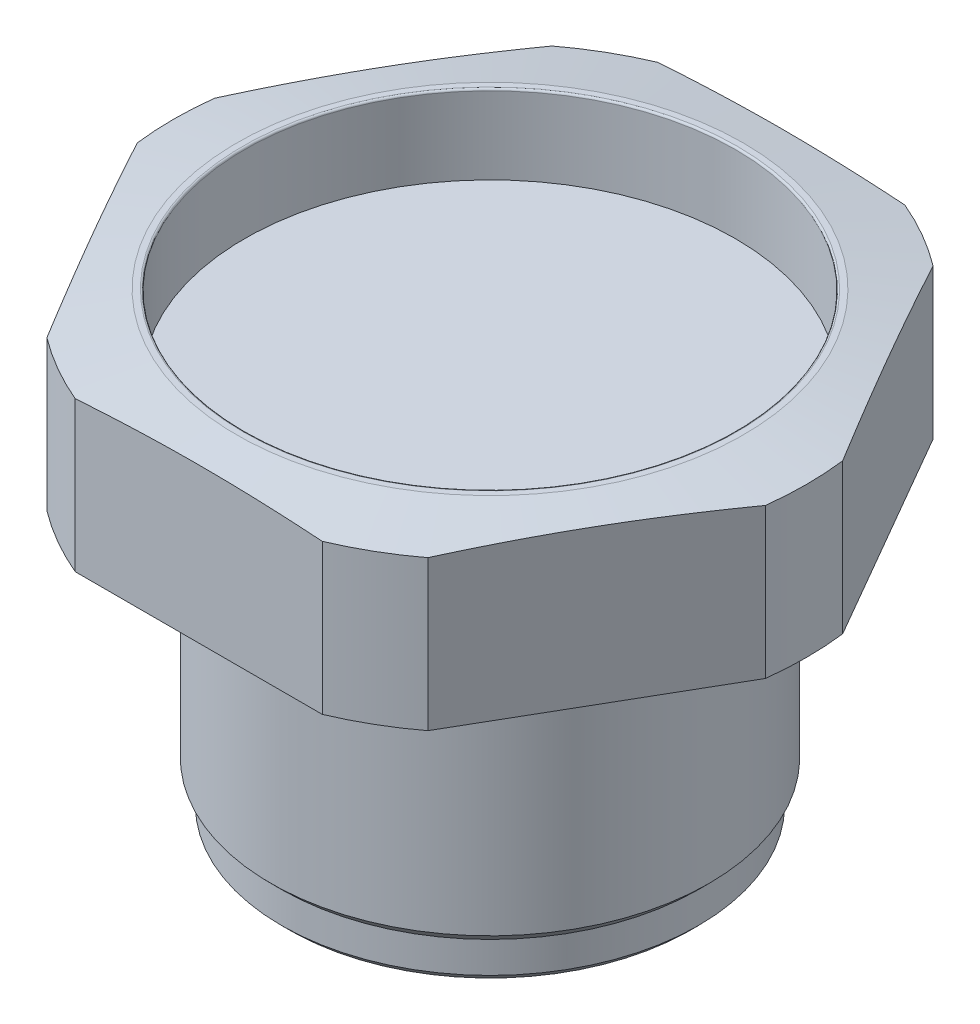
ISO-10303-21;
HEADER;
FILE_DESCRIPTION(('STEP AP214'),'2;1');
FILE_NAME('part.step','',(''),(''),'','','');
FILE_SCHEMA(('AUTOMOTIVE_DESIGN { 1 0 10303 214 1 1 1 1 }'));
ENDSEC;
DATA;
#1=APPLICATION_CONTEXT('core data for automotive mechanical design processes');
#2=APPLICATION_PROTOCOL_DEFINITION('international standard','automotive_design',2000,#1);
#3=PRODUCT_CONTEXT('',#1,'mechanical');
#4=PRODUCT('Part','Part','',(#3));
#5=PRODUCT_RELATED_PRODUCT_CATEGORY('part','',(#4));
#6=PRODUCT_DEFINITION_FORMATION('','',#4);
#7=PRODUCT_DEFINITION_CONTEXT('part definition',#1,'design');
#8=PRODUCT_DEFINITION('design','',#6,#7);
#9=PRODUCT_DEFINITION_SHAPE('','',#8);
#10=(LENGTH_UNIT() NAMED_UNIT(*) SI_UNIT(.MILLI.,.METRE.));
#11=(NAMED_UNIT(*) PLANE_ANGLE_UNIT() SI_UNIT($,.RADIAN.));
#12=(NAMED_UNIT(*) SI_UNIT($,.STERADIAN.) SOLID_ANGLE_UNIT());
#13=UNCERTAINTY_MEASURE_WITH_UNIT(LENGTH_MEASURE(1.E-05),#10,'distance_accuracy_value','');
#14=(GEOMETRIC_REPRESENTATION_CONTEXT(3) GLOBAL_UNCERTAINTY_ASSIGNED_CONTEXT((#13)) GLOBAL_UNIT_ASSIGNED_CONTEXT((#10,
#11,#12)) REPRESENTATION_CONTEXT('',''));
#15=CARTESIAN_POINT('',(0.,0.,0.));
#16=DIRECTION('',(0.,0.,1.));
#17=DIRECTION('',(1.,0.,0.));
#18=AXIS2_PLACEMENT_3D('',#15,#16,#17);
#19=CARTESIAN_POINT('',(27.178,-38.354,0.));
#20=DIRECTION('',(0.,-1.,0.));
#21=DIRECTION('',(0.,0.,-1.));
#22=AXIS2_PLACEMENT_3D('',#19,#20,#21);
#23=PLANE('',#22);
#24=CARTESIAN_POINT('',(0.,-38.354,0.));
#25=DIRECTION('',(0.,-1.,0.));
#26=DIRECTION('',(0.,0.,-1.));
#27=AXIS2_PLACEMENT_3D('',#24,#25,#26);
#28=CIRCLE('',#27,23.7209044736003);
#29=CARTESIAN_POINT('',(0.,-38.354,-23.7209044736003));
#30=VERTEX_POINT('',#29);
#31=EDGE_CURVE('E195',#30,#30,#28,.T.);
#32=ORIENTED_EDGE('',*,*,#31,.F.);
#33=EDGE_LOOP('',(#32));
#34=FACE_BOUND('',#33,.T.);
#35=CARTESIAN_POINT('',(0.,-38.354,0.));
#36=DIRECTION('',(0.,-1.,0.));
#37=DIRECTION('',(0.,0.,-1.));
#38=AXIS2_PLACEMENT_3D('',#35,#36,#37);
#39=CIRCLE('',#38,26.162);
#40=CARTESIAN_POINT('',(0.,-38.354,-26.162));
#41=VERTEX_POINT('',#40);
#42=EDGE_CURVE('E177',#41,#41,#39,.T.);
#43=ORIENTED_EDGE('',*,*,#42,.T.);
#44=EDGE_LOOP('',(#43));
#45=FACE_BOUND('',#44,.T.);
#46=ADVANCED_FACE('F33',(#34,#45),#23,.T.);
#47=CARTESIAN_POINT('',(0.,-8.96894233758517,0.));
#48=DIRECTION('',(0.,-1.,0.));
#49=DIRECTION('',(0.,0.,-1.));
#50=AXIS2_PLACEMENT_3D('',#47,#48,#49);
#51=CYLINDRICAL_SURFACE('',#50,27.178);
#52=CARTESIAN_POINT('',(0.,-0.508000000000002,0.));
#53=DIRECTION('',(0.,-1.,0.));
#54=DIRECTION('',(0.,0.,-1.));
#55=AXIS2_PLACEMENT_3D('',#52,#53,#54);
#56=CIRCLE('',#55,27.178);
#57=CARTESIAN_POINT('',(0.,-0.508000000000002,-27.178));
#58=VERTEX_POINT('',#57);
#59=EDGE_CURVE('E189',#58,#58,#56,.T.);
#60=ORIENTED_EDGE('',*,*,#59,.T.);
#61=EDGE_LOOP('',(#60));
#62=FACE_BOUND('',#61,.T.);
#63=CARTESIAN_POINT('',(0.,-5.08,0.));
#64=DIRECTION('',(0.,-1.,0.));
#65=DIRECTION('',(1.,0.,0.));
#66=AXIS2_PLACEMENT_3D('',#63,#64,#65);
#67=CIRCLE('',#66,27.178);
#68=CARTESIAN_POINT('',(27.178,-5.08,0.));
#69=VERTEX_POINT('',#68);
#70=EDGE_CURVE('E186',#69,#69,#67,.T.);
#71=ORIENTED_EDGE('',*,*,#70,.F.);
#72=EDGE_LOOP('',(#71));
#73=FACE_BOUND('',#72,.T.);
#74=ADVANCED_FACE('F216',(#62,#73),#51,.T.);
#75=CARTESIAN_POINT('',(0.,19.5502207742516,0.));
#76=DIRECTION('',(0.,-1.,0.));
#77=DIRECTION('',(0.,0.,-1.));
#78=AXIS2_PLACEMENT_3D('',#75,#76,#77);
#79=CONICAL_SURFACE('',#78,41.275,1.39626340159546);
#80=CARTESIAN_POINT('',(0.,21.0058,0.));
#81=DIRECTION('',(0.,-1.,0.));
#82=DIRECTION('',(0.,0.,-1.));
#83=AXIS2_PLACEMENT_3D('',#80,#81,#82);
#84=CIRCLE('',#83,33.02);
#85=CARTESIAN_POINT('',(0.,21.0058,-33.02));
#86=VERTEX_POINT('',#85);
#87=EDGE_CURVE('E386',#86,#86,#84,.T.);
#88=ORIENTED_EDGE('',*,*,#87,.T.);
#89=EDGE_LOOP('',(#88));
#90=FACE_BOUND('',#89,.T.);
#91=CARTESIAN_POINT('',(0.,19.5502207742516,0.));
#92=DIRECTION('',(0.,-1.,0.));
#93=DIRECTION('',(0.,0.,-1.));
#94=AXIS2_PLACEMENT_3D('',#91,#92,#93);
#95=CIRCLE('',#94,41.275);
#96=CARTESIAN_POINT('',(-40.9659173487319,19.5502207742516,5.04174977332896));
#97=VERTEX_POINT('',#96);
#98=CARTESIAN_POINT('',(-40.9659173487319,19.5502207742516,-5.04174977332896));
#99=VERTEX_POINT('',#98);
#100=EDGE_CURVE('E137',#97,#99,#95,.T.);
#101=ORIENTED_EDGE('',*,*,#100,.F.);
#102=CARTESIAN_POINT('',(-40.9673696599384,19.5500207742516,5.0392342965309));
#103=CARTESIAN_POINT('',(-40.6318536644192,19.5962299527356,5.62036504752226));
#104=CARTESIAN_POINT('',(-40.2962544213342,19.640002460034,6.20163998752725));
#105=CARTESIAN_POINT('',(-39.6248953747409,19.7223985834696,7.36446796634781));
#106=CARTESIAN_POINT('',(-39.2891355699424,19.7610221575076,7.94602100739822));
#107=CARTESIAN_POINT('',(-38.2816022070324,19.8687583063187,9.691119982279));
#108=CARTESIAN_POINT('',(-37.609604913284,19.9297320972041,10.8550534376));
#109=CARTESIAN_POINT('',(-36.2660437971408,20.0280404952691,13.182169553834));
#110=CARTESIAN_POINT('',(-35.5944805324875,20.0654054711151,14.3453512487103));
#111=CARTESIAN_POINT('',(-34.251138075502,20.1153717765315,16.6720886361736));
#112=CARTESIAN_POINT('',(-33.5793588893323,20.127973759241,17.8356443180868));
#113=CARTESIAN_POINT('',(-32.2358005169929,20.127973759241,20.1627556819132));
#114=CARTESIAN_POINT('',(-31.5640213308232,20.1153717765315,21.3263113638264));
#115=CARTESIAN_POINT('',(-30.2206788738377,20.0654054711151,23.6530487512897));
#116=CARTESIAN_POINT('',(-29.5491156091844,20.0280404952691,24.816230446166));
#117=CARTESIAN_POINT('',(-28.2055544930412,19.9297320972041,27.1433465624));
#118=CARTESIAN_POINT('',(-27.5335571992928,19.8687583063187,28.307280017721));
#119=CARTESIAN_POINT('',(-26.5260238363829,19.7610221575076,30.0523789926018));
#120=CARTESIAN_POINT('',(-26.1902640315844,19.7223985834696,30.6339320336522));
#121=CARTESIAN_POINT('',(-25.5189049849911,19.640002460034,31.7967600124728));
#122=CARTESIAN_POINT('',(-25.183305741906,19.5962299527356,32.3780349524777));
#123=CARTESIAN_POINT('',(-24.8477897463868,19.5500207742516,32.9591657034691));
#124=B_SPLINE_CURVE_WITH_KNOTS('',3,(#102,#103,#104,#105,#106,#107,#108,#109,#110,#111,#112,
#113,#114,#115,#116,#117,#118,#119,#120,#121,#122,#123),.UNSPECIFIED.,.F.,.F.,(4,2,2,2,2,2,2,2,
2,2,4),(0.,2.01785524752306,4.03572699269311,8.07165217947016,12.1023752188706,16.132991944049,
20.1636086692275,24.1943317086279,28.230256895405,30.248128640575,32.2659838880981),.UNSPECIFIED.);
#125=CARTESIAN_POINT('',(-24.8492420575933,19.5502207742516,32.956650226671));
#126=VERTEX_POINT('',#125);
#127=EDGE_CURVE('E385',#97,#126,#124,.T.);
#128=ORIENTED_EDGE('',*,*,#127,.T.);
#129=CARTESIAN_POINT('',(-16.1166752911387,19.5502207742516,37.9984));
#130=VERTEX_POINT('',#129);
#131=EDGE_CURVE('E377',#130,#126,#95,.T.);
#132=ORIENTED_EDGE('',*,*,#131,.F.);
#133=CARTESIAN_POINT('',(-57.8639051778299,14.6218698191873,37.9984));
#134=CARTESIAN_POINT('',(-57.0019930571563,14.7489031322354,37.9984));
#135=CARTESIAN_POINT('',(-56.139958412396,14.8751046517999,37.9984));
#136=CARTESIAN_POINT('',(-54.4156199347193,15.125664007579,37.9984));
#137=CARTESIAN_POINT('',(-53.5533161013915,15.2500218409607,37.9984));
#138=CARTESIAN_POINT('',(-50.9659374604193,15.6200635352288,37.9984));
#139=CARTESIAN_POINT('',(-49.2404266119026,15.8627109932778,37.9984));
#140=CARTESIAN_POINT('',(-45.7873021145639,16.3382293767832,37.9984));
#141=CARTESIAN_POINT('',(-44.0596878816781,16.5710960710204,37.9984));
#142=CARTESIAN_POINT('',(-40.6028670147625,17.0246892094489,37.9984));
#143=CARTESIAN_POINT('',(-38.8736603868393,17.245415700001,37.9984));
#144=CARTESIAN_POINT('',(-35.419217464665,17.6711956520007,37.9984));
#145=CARTESIAN_POINT('',(-33.6939873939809,17.8762993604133,37.9984));
#146=CARTESIAN_POINT('',(-30.2414345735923,18.2682133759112,37.9984));
#147=CARTESIAN_POINT('',(-28.5141118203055,18.4550236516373,37.9984));
#148=CARTESIAN_POINT('',(-25.0572784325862,18.8062070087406,37.9984));
#149=CARTESIAN_POINT('',(-23.3277679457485,18.9705815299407,37.9984));
#150=CARTESIAN_POINT('',(-19.8663595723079,19.2721663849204,37.9984));
#151=CARTESIAN_POINT('',(-18.1344616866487,19.4093767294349,37.9984));
#152=CARTESIAN_POINT('',(-14.6602163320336,19.6521327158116,37.9984));
#153=CARTESIAN_POINT('',(-12.9178580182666,19.7575264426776,37.9984));
#154=CARTESIAN_POINT('',(-10.3029433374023,19.8876204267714,37.9984));
#155=CARTESIAN_POINT('',(-9.43107075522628,19.9263191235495,37.9984));
#156=CARTESIAN_POINT('',(-7.68694739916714,19.9938955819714,37.9984));
#157=CARTESIAN_POINT('',(-6.81469662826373,20.0227734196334,37.9984));
#158=CARTESIAN_POINT('',(-5.0700654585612,20.0703033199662,37.9984));
#159=CARTESIAN_POINT('',(-4.19768510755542,20.0889571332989,37.9984));
#160=CARTESIAN_POINT('',(-2.45276864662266,20.1157789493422,37.9984));
#161=CARTESIAN_POINT('',(-1.58023253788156,20.1239470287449,37.9984));
#162=CARTESIAN_POINT('',(0.164877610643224,20.1296767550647,37.9984));
#163=CARTESIAN_POINT('',(1.03745165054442,20.1272383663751,37.9984));
#164=CARTESIAN_POINT('',(2.78250560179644,20.1117916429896,37.9984));
#165=CARTESIAN_POINT('',(3.65498551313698,20.0987833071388,37.9984));
#166=CARTESIAN_POINT('',(5.40109406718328,20.0623572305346,37.9984));
#167=CARTESIAN_POINT('',(6.27472237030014,20.0389232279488,37.9984));
#168=CARTESIAN_POINT('',(8.0216525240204,19.9819781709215,37.9984));
#169=CARTESIAN_POINT('',(8.89495437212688,19.9484670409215,37.9984));
#170=CARTESIAN_POINT('',(11.5142177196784,19.833470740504,37.9984));
#171=CARTESIAN_POINT('',(13.2595585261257,19.7375221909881,37.9984));
#172=CARTESIAN_POINT('',(16.748434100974,19.5116068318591,37.9984));
#173=CARTESIAN_POINT('',(18.4919682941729,19.3816313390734,37.9984));
#174=CARTESIAN_POINT('',(21.9766261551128,19.0928384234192,37.9984));
#175=CARTESIAN_POINT('',(23.7177498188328,18.9340209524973,37.9984));
#176=CARTESIAN_POINT('',(27.1033127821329,18.6017526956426,37.9984));
#177=CARTESIAN_POINT('',(28.7478770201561,18.4295617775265,37.9984));
#178=CARTESIAN_POINT('',(32.0350715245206,18.0675285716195,37.9984));
#179=CARTESIAN_POINT('',(33.6777017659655,17.8776860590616,37.9984));
#180=CARTESIAN_POINT('',(36.9612926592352,17.4835029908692,37.9984));
#181=CARTESIAN_POINT('',(38.6022532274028,17.279161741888,37.9984));
#182=CARTESIAN_POINT('',(41.8826385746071,16.8585980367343,37.9984));
#183=CARTESIAN_POINT('',(43.5220633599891,16.6423756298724,37.9984));
#184=CARTESIAN_POINT('',(46.7998380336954,16.2001333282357,37.9984));
#185=CARTESIAN_POINT('',(48.4381877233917,15.974111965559,37.9984));
#186=CARTESIAN_POINT('',(51.7137535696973,15.5140087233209,37.9984));
#187=CARTESIAN_POINT('',(53.3509697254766,15.2799268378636,37.9984));
#188=CARTESIAN_POINT('',(56.624382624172,14.805081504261,37.9984));
#189=CARTESIAN_POINT('',(58.2605793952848,14.5643182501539,37.9984));
#190=CARTESIAN_POINT('',(61.5321396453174,14.0772070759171,37.9984));
#191=CARTESIAN_POINT('',(63.1675031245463,13.8308591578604,37.9984));
#192=CARTESIAN_POINT('',(66.430533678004,13.3345330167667,37.9984));
#193=CARTESIAN_POINT('',(68.0582037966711,13.0845747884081,37.9984));
#194=CARTESIAN_POINT('',(71.3129338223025,12.5807143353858,37.9984));
#195=CARTESIAN_POINT('',(72.9399937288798,12.3268121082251,37.9984));
#196=CARTESIAN_POINT('',(77.8204109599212,11.5600905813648,37.9984));
#197=CARTESIAN_POINT('',(81.07298140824,11.0422601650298,37.9984));
#198=CARTESIAN_POINT('',(85.9496272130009,10.2582808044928,37.9984));
#199=CARTESIAN_POINT('',(87.5742999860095,9.99583189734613,37.9984));
#200=CARTESIAN_POINT('',(90.8232964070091,9.46877892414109,37.9984));
#201=CARTESIAN_POINT('',(92.4476200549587,9.20417485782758,37.9984));
#202=CARTESIAN_POINT('',(95.6959355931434,8.67309809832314,37.9984));
#203=CARTESIAN_POINT('',(97.3199274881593,8.40662543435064,37.9984));
#204=CARTESIAN_POINT('',(100.567638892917,7.87203038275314,37.9984));
#205=CARTESIAN_POINT('',(102.191358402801,7.60390799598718,37.9984));
#206=CARTESIAN_POINT('',(103.814959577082,7.33507210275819,37.9984));
#207=B_SPLINE_CURVE_WITH_KNOTS('',3,(#133,#134,#135,#136,#137,#138,#139,#140,#141,#142,#143,
#144,#145,#146,#147,#148,#149,#150,#151,#152,#153,#154,#155,#156,#157,#158,#159,#160,#161,#162,
#163,#164,#165,#166,#167,#168,#169,#170,#171,#172,#173,#174,#175,#176,#177,#178,#179,#180,#181,
#182,#183,#184,#185,#186,#187,#188,#189,#190,#191,#192,#193,#194,#195,#196,#197,#198,#199,#200,
#201,#202,#203,#204,#205,#206),.UNSPECIFIED.,.F.,.F.,(4,2,2,2,2,2,2,2,2,2,2,2,2,2,2,2,2,2,2,2,2,
2,2,2,2,2,2,2,2,2,2,2,2,2,2,2,4),(0.,2.6136690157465,5.22734204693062,10.454782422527,
15.6844614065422,20.9141204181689,26.1261792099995,31.3382469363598,36.549980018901,
41.7617110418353,46.9979466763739,49.6160934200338,52.2342198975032,54.8518979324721,
57.4695568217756,60.0872244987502,62.7048924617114,65.3266578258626,67.9484428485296,
73.1919483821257,78.4367932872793,83.681646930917,88.6421976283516,93.602811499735,
98.5636627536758,103.524493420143,108.486069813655,113.447649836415,118.409085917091,
123.37052015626,128.310767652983,133.251018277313,143.131593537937,148.068795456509,
153.005997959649,157.943123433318,162.880246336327),.UNSPECIFIED.);
#208=CARTESIAN_POINT('',(16.1166752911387,19.5502207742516,37.9984));
#209=VERTEX_POINT('',#208);
#210=EDGE_CURVE('E285',#130,#209,#207,.T.);
#211=ORIENTED_EDGE('',*,*,#210,.T.);
#212=CARTESIAN_POINT('',(24.8492420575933,19.5502207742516,32.956650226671));
#213=VERTEX_POINT('',#212);
#214=EDGE_CURVE('E349',#213,#209,#95,.T.);
#215=ORIENTED_EDGE('',*,*,#214,.F.);
#216=CARTESIAN_POINT('',(24.8477897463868,19.5500207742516,32.9591657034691));
#217=CARTESIAN_POINT('',(25.183305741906,19.5962299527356,32.3780349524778));
#218=CARTESIAN_POINT('',(25.5189049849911,19.640002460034,31.7967600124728));
#219=CARTESIAN_POINT('',(26.1902640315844,19.7223985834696,30.6339320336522));
#220=CARTESIAN_POINT('',(26.5260238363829,19.7610221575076,30.0523789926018));
#221=CARTESIAN_POINT('',(27.5335571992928,19.8687583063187,28.307280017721));
#222=CARTESIAN_POINT('',(28.2055544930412,19.9297320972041,27.1433465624));
#223=CARTESIAN_POINT('',(29.5491156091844,20.0280404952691,24.8162304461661));
#224=CARTESIAN_POINT('',(30.2206788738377,20.0654054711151,23.6530487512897));
#225=CARTESIAN_POINT('',(31.5640213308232,20.1153717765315,21.3263113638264));
#226=CARTESIAN_POINT('',(32.2358005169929,20.127973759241,20.1627556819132));
#227=CARTESIAN_POINT('',(33.5793588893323,20.127973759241,17.8356443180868));
#228=CARTESIAN_POINT('',(34.251138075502,20.1153717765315,16.6720886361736));
#229=CARTESIAN_POINT('',(35.5944805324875,20.0654054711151,14.3453512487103));
#230=CARTESIAN_POINT('',(36.2660437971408,20.0280404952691,13.182169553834));
#231=CARTESIAN_POINT('',(37.609604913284,19.9297320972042,10.8550534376));
#232=CARTESIAN_POINT('',(38.2816022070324,19.8687583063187,9.69111998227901));
#233=CARTESIAN_POINT('',(39.2891355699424,19.7610221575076,7.94602100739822));
#234=CARTESIAN_POINT('',(39.6248953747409,19.7223985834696,7.36446796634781));
#235=CARTESIAN_POINT('',(40.2962544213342,19.640002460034,6.20163998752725));
#236=CARTESIAN_POINT('',(40.6318536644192,19.5962299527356,5.62036504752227));
#237=CARTESIAN_POINT('',(40.9673696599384,19.5500207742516,5.0392342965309));
#238=B_SPLINE_CURVE_WITH_KNOTS('',3,(#216,#217,#218,#219,#220,#221,#222,#223,#224,#225,#226,
#227,#228,#229,#230,#231,#232,#233,#234,#235,#236,#237),.UNSPECIFIED.,.F.,.F.,(4,2,2,2,2,2,2,2,
2,2,4),(0.,2.01785524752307,4.03572699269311,8.07165217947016,12.1023752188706,16.132991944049,
20.1636086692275,24.1943317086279,28.230256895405,30.248128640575,32.2659838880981),.UNSPECIFIED.);
#239=CARTESIAN_POINT('',(40.9659173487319,19.5502207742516,5.04174977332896));
#240=VERTEX_POINT('',#239);
#241=EDGE_CURVE('E333',#213,#240,#238,.T.);
#242=ORIENTED_EDGE('',*,*,#241,.T.);
#243=CARTESIAN_POINT('',(40.9659173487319,19.5502207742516,-5.04174977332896));
#244=VERTEX_POINT('',#243);
#245=EDGE_CURVE('E160',#244,#240,#95,.T.);
#246=ORIENTED_EDGE('',*,*,#245,.F.);
#247=CARTESIAN_POINT('',(40.9673696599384,19.5500207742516,-5.0392342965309));
#248=CARTESIAN_POINT('',(40.6318536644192,19.5962299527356,-5.62036504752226));
#249=CARTESIAN_POINT('',(40.2962544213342,19.640002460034,-6.20163998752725));
#250=CARTESIAN_POINT('',(39.6248953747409,19.7223985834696,-7.36446796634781));
#251=CARTESIAN_POINT('',(39.2891355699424,19.7610221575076,-7.94602100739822));
#252=CARTESIAN_POINT('',(38.2816022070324,19.8687583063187,-9.691119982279));
#253=CARTESIAN_POINT('',(37.609604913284,19.9297320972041,-10.8550534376));
#254=CARTESIAN_POINT('',(36.2660437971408,20.0280404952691,-13.182169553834));
#255=CARTESIAN_POINT('',(35.5944805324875,20.0654054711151,-14.3453512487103));
#256=CARTESIAN_POINT('',(34.251138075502,20.1153717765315,-16.6720886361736));
#257=CARTESIAN_POINT('',(33.5793588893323,20.127973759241,-17.8356443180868));
#258=CARTESIAN_POINT('',(32.2358005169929,20.127973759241,-20.1627556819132));
#259=CARTESIAN_POINT('',(31.5640213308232,20.1153717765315,-21.3263113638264));
#260=CARTESIAN_POINT('',(30.2206788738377,20.0654054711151,-23.6530487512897));
#261=CARTESIAN_POINT('',(29.5491156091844,20.0280404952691,-24.816230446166));
#262=CARTESIAN_POINT('',(28.2055544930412,19.9297320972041,-27.1433465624));
#263=CARTESIAN_POINT('',(27.5335571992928,19.8687583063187,-28.307280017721));
#264=CARTESIAN_POINT('',(26.5260238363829,19.7610221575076,-30.0523789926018));
#265=CARTESIAN_POINT('',(26.1902640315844,19.7223985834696,-30.6339320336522));
#266=CARTESIAN_POINT('',(25.5189049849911,19.640002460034,-31.7967600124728));
#267=CARTESIAN_POINT('',(25.183305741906,19.5962299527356,-32.3780349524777));
#268=CARTESIAN_POINT('',(24.8477897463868,19.5500207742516,-32.9591657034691));
#269=B_SPLINE_CURVE_WITH_KNOTS('',3,(#247,#248,#249,#250,#251,#252,#253,#254,#255,#256,#257,
#258,#259,#260,#261,#262,#263,#264,#265,#266,#267,#268),.UNSPECIFIED.,.F.,.F.,(4,2,2,2,2,2,2,2,
2,2,4),(0.,2.01785524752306,4.03572699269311,8.07165217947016,12.1023752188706,16.132991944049,
20.1636086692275,24.1943317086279,28.230256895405,30.248128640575,32.2659838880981),.UNSPECIFIED.);
#270=CARTESIAN_POINT('',(24.8492420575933,19.5502207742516,-32.956650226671));
#271=VERTEX_POINT('',#270);
#272=EDGE_CURVE('E326',#244,#271,#269,.T.);
#273=ORIENTED_EDGE('',*,*,#272,.T.);
#274=CARTESIAN_POINT('',(16.1166752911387,19.5502207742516,-37.9984));
#275=VERTEX_POINT('',#274);
#276=EDGE_CURVE('E156',#275,#271,#95,.T.);
#277=ORIENTED_EDGE('',*,*,#276,.F.);
#278=CARTESIAN_POINT('',(-57.8639051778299,14.6218698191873,-37.9984));
#279=CARTESIAN_POINT('',(-57.0019930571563,14.7489031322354,-37.9984));
#280=CARTESIAN_POINT('',(-56.139958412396,14.8751046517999,-37.9984));
#281=CARTESIAN_POINT('',(-54.4156199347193,15.125664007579,-37.9984));
#282=CARTESIAN_POINT('',(-53.5533161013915,15.2500218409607,-37.9984));
#283=CARTESIAN_POINT('',(-50.9659374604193,15.6200635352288,-37.9984));
#284=CARTESIAN_POINT('',(-49.2404266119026,15.8627109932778,-37.9984));
#285=CARTESIAN_POINT('',(-45.7873021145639,16.3382293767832,-37.9984));
#286=CARTESIAN_POINT('',(-44.0596878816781,16.5710960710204,-37.9984));
#287=CARTESIAN_POINT('',(-40.6028670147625,17.0246892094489,-37.9984));
#288=CARTESIAN_POINT('',(-38.8736603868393,17.245415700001,-37.9984));
#289=CARTESIAN_POINT('',(-35.419217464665,17.6711956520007,-37.9984));
#290=CARTESIAN_POINT('',(-33.6939873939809,17.8762993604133,-37.9984));
#291=CARTESIAN_POINT('',(-30.2414345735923,18.2682133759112,-37.9984));
#292=CARTESIAN_POINT('',(-28.5141118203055,18.4550236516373,-37.9984));
#293=CARTESIAN_POINT('',(-25.0572784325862,18.8062070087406,-37.9984));
#294=CARTESIAN_POINT('',(-23.3277679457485,18.9705815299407,-37.9984));
#295=CARTESIAN_POINT('',(-19.8663595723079,19.2721663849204,-37.9984));
#296=CARTESIAN_POINT('',(-18.1344616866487,19.4093767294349,-37.9984));
#297=CARTESIAN_POINT('',(-14.6602163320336,19.6521327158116,-37.9984));
#298=CARTESIAN_POINT('',(-12.9178580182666,19.7575264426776,-37.9984));
#299=CARTESIAN_POINT('',(-10.3029433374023,19.8876204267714,-37.9984));
#300=CARTESIAN_POINT('',(-9.43107075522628,19.9263191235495,-37.9984));
#301=CARTESIAN_POINT('',(-7.68694739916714,19.9938955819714,-37.9984));
#302=CARTESIAN_POINT('',(-6.81469662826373,20.0227734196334,-37.9984));
#303=CARTESIAN_POINT('',(-5.0700654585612,20.0703033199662,-37.9984));
#304=CARTESIAN_POINT('',(-4.19768510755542,20.0889571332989,-37.9984));
#305=CARTESIAN_POINT('',(-2.45276864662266,20.1157789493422,-37.9984));
#306=CARTESIAN_POINT('',(-1.58023253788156,20.1239470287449,-37.9984));
#307=CARTESIAN_POINT('',(0.164877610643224,20.1296767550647,-37.9984));
#308=CARTESIAN_POINT('',(1.03745165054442,20.1272383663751,-37.9984));
#309=CARTESIAN_POINT('',(2.78250560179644,20.1117916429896,-37.9984));
#310=CARTESIAN_POINT('',(3.65498551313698,20.0987833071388,-37.9984));
#311=CARTESIAN_POINT('',(5.40109406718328,20.0623572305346,-37.9984));
#312=CARTESIAN_POINT('',(6.27472237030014,20.0389232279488,-37.9984));
#313=CARTESIAN_POINT('',(8.0216525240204,19.9819781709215,-37.9984));
#314=CARTESIAN_POINT('',(8.89495437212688,19.9484670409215,-37.9984));
#315=CARTESIAN_POINT('',(11.5142177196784,19.833470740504,-37.9984));
#316=CARTESIAN_POINT('',(13.2595585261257,19.7375221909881,-37.9984));
#317=CARTESIAN_POINT('',(16.748434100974,19.5116068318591,-37.9984));
#318=CARTESIAN_POINT('',(18.4919682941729,19.3816313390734,-37.9984));
#319=CARTESIAN_POINT('',(21.9766261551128,19.0928384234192,-37.9984));
#320=CARTESIAN_POINT('',(23.7177498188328,18.9340209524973,-37.9984));
#321=CARTESIAN_POINT('',(27.1033127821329,18.6017526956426,-37.9984));
#322=CARTESIAN_POINT('',(28.7478770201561,18.4295617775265,-37.9984));
#323=CARTESIAN_POINT('',(32.0350715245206,18.0675285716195,-37.9984));
#324=CARTESIAN_POINT('',(33.6777017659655,17.8776860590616,-37.9984));
#325=CARTESIAN_POINT('',(36.9612926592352,17.4835029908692,-37.9984));
#326=CARTESIAN_POINT('',(38.6022532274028,17.279161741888,-37.9984));
#327=CARTESIAN_POINT('',(41.8826385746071,16.8585980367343,-37.9984));
#328=CARTESIAN_POINT('',(43.5220633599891,16.6423756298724,-37.9984));
#329=CARTESIAN_POINT('',(46.7998380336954,16.2001333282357,-37.9984));
#330=CARTESIAN_POINT('',(48.4381877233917,15.974111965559,-37.9984));
#331=CARTESIAN_POINT('',(51.7137535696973,15.5140087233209,-37.9984));
#332=CARTESIAN_POINT('',(53.3509697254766,15.2799268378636,-37.9984));
#333=CARTESIAN_POINT('',(56.624382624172,14.805081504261,-37.9984));
#334=CARTESIAN_POINT('',(58.2605793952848,14.5643182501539,-37.9984));
#335=CARTESIAN_POINT('',(61.5321396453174,14.0772070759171,-37.9984));
#336=CARTESIAN_POINT('',(63.1675031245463,13.8308591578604,-37.9984));
#337=CARTESIAN_POINT('',(66.430533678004,13.3345330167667,-37.9984));
#338=CARTESIAN_POINT('',(68.0582037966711,13.0845747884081,-37.9984));
#339=CARTESIAN_POINT('',(71.3129338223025,12.5807143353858,-37.9984));
#340=CARTESIAN_POINT('',(72.9399937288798,12.3268121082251,-37.9984));
#341=CARTESIAN_POINT('',(77.8204109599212,11.5600905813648,-37.9984));
#342=CARTESIAN_POINT('',(81.07298140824,11.0422601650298,-37.9984));
#343=CARTESIAN_POINT('',(85.9496272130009,10.2582808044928,-37.9984));
#344=CARTESIAN_POINT('',(87.5742999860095,9.99583189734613,-37.9984));
#345=CARTESIAN_POINT('',(90.8232964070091,9.46877892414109,-37.9984));
#346=CARTESIAN_POINT('',(92.4476200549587,9.20417485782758,-37.9984));
#347=CARTESIAN_POINT('',(95.6959355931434,8.67309809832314,-37.9984));
#348=CARTESIAN_POINT('',(97.3199274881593,8.40662543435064,-37.9984));
#349=CARTESIAN_POINT('',(100.567638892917,7.87203038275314,-37.9984));
#350=CARTESIAN_POINT('',(102.191358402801,7.60390799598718,-37.9984));
#351=CARTESIAN_POINT('',(103.814959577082,7.33507210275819,-37.9984));
#352=B_SPLINE_CURVE_WITH_KNOTS('',3,(#278,#279,#280,#281,#282,#283,#284,#285,#286,#287,#288,
#289,#290,#291,#292,#293,#294,#295,#296,#297,#298,#299,#300,#301,#302,#303,#304,#305,#306,#307,
#308,#309,#310,#311,#312,#313,#314,#315,#316,#317,#318,#319,#320,#321,#322,#323,#324,#325,#326,
#327,#328,#329,#330,#331,#332,#333,#334,#335,#336,#337,#338,#339,#340,#341,#342,#343,#344,#345,
#346,#347,#348,#349,#350,#351),.UNSPECIFIED.,.F.,.F.,(4,2,2,2,2,2,2,2,2,2,2,2,2,2,2,2,2,2,2,2,2,
2,2,2,2,2,2,2,2,2,2,2,2,2,2,2,4),(0.,2.6136690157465,5.22734204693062,10.454782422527,
15.6844614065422,20.9141204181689,26.1261792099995,31.3382469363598,36.549980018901,
41.7617110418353,46.9979466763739,49.6160934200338,52.2342198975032,54.8518979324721,
57.4695568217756,60.0872244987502,62.7048924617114,65.3266578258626,67.9484428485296,
73.1919483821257,78.4367932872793,83.681646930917,88.6421976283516,93.602811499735,
98.5636627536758,103.524493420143,108.486069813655,113.447649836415,118.409085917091,
123.37052015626,128.310767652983,133.251018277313,143.131593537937,148.068795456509,
153.005997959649,157.943123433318,162.880246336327),.UNSPECIFIED.);
#353=CARTESIAN_POINT('',(-16.1166752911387,19.5502207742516,-37.9984));
#354=VERTEX_POINT('',#353);
#355=EDGE_CURVE('E317',#275,#354,#352,.F.);
#356=ORIENTED_EDGE('',*,*,#355,.T.);
#357=CARTESIAN_POINT('',(-24.8492420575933,19.5502207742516,-32.956650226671));
#358=VERTEX_POINT('',#357);
#359=EDGE_CURVE('E153',#358,#354,#95,.T.);
#360=ORIENTED_EDGE('',*,*,#359,.F.);
#361=CARTESIAN_POINT('',(-24.8477897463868,19.5500207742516,-32.9591657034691));
#362=CARTESIAN_POINT('',(-25.183305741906,19.5962299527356,-32.3780349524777));
#363=CARTESIAN_POINT('',(-25.5189049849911,19.640002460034,-31.7967600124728));
#364=CARTESIAN_POINT('',(-26.1902640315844,19.7223985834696,-30.6339320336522));
#365=CARTESIAN_POINT('',(-26.5260238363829,19.7610221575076,-30.0523789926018));
#366=CARTESIAN_POINT('',(-27.5335571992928,19.8687583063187,-28.307280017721));
#367=CARTESIAN_POINT('',(-28.2055544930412,19.9297320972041,-27.1433465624));
#368=CARTESIAN_POINT('',(-29.5491156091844,20.0280404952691,-24.816230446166));
#369=CARTESIAN_POINT('',(-30.2206788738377,20.0654054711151,-23.6530487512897));
#370=CARTESIAN_POINT('',(-31.5640213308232,20.1153717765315,-21.3263113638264));
#371=CARTESIAN_POINT('',(-32.2358005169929,20.127973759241,-20.1627556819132));
#372=CARTESIAN_POINT('',(-33.5793588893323,20.127973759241,-17.8356443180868));
#373=CARTESIAN_POINT('',(-34.251138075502,20.1153717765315,-16.6720886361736));
#374=CARTESIAN_POINT('',(-35.5944805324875,20.0654054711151,-14.3453512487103));
#375=CARTESIAN_POINT('',(-36.2660437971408,20.0280404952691,-13.182169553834));
#376=CARTESIAN_POINT('',(-37.609604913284,19.9297320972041,-10.8550534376));
#377=CARTESIAN_POINT('',(-38.2816022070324,19.8687583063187,-9.69111998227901));
#378=CARTESIAN_POINT('',(-39.2891355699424,19.7610221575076,-7.94602100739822));
#379=CARTESIAN_POINT('',(-39.6248953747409,19.7223985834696,-7.36446796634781));
#380=CARTESIAN_POINT('',(-40.2962544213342,19.640002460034,-6.20163998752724));
#381=CARTESIAN_POINT('',(-40.6318536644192,19.5962299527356,-5.62036504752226));
#382=CARTESIAN_POINT('',(-40.9673696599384,19.5500207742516,-5.03923429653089));
#383=B_SPLINE_CURVE_WITH_KNOTS('',3,(#361,#362,#363,#364,#365,#366,#367,#368,#369,#370,#371,
#372,#373,#374,#375,#376,#377,#378,#379,#380,#381,#382),.UNSPECIFIED.,.F.,.F.,(4,2,2,2,2,2,2,2,
2,2,4),(0.,2.01785524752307,4.03572699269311,8.07165217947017,12.1023752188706,16.132991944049,
20.1636086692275,24.1943317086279,28.230256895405,30.248128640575,32.2659838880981),.UNSPECIFIED.);
#384=EDGE_CURVE('E138',#358,#99,#383,.T.);
#385=ORIENTED_EDGE('',*,*,#384,.T.);
#386=EDGE_LOOP('',(#101,#128,#132,#211,#215,#242,#246,#273,#277,#356,#360,#385));
#387=FACE_BOUND('',#386,.T.);
#388=ADVANCED_FACE('F223',(#90,#387),#79,.T.);
#389=CARTESIAN_POINT('',(0.,-8.96894233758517,0.));
#390=DIRECTION('',(0.,-1.,0.));
#391=DIRECTION('',(0.,0.,-1.));
#392=AXIS2_PLACEMENT_3D('',#389,#390,#391);
#393=CYLINDRICAL_SURFACE('',#392,41.275);
#394=CARTESIAN_POINT('',(0.,0.,0.));
#395=DIRECTION('',(0.,-1.,0.));
#396=DIRECTION('',(0.,0.,-1.));
#397=AXIS2_PLACEMENT_3D('',#394,#395,#396);
#398=CIRCLE('',#397,41.275);
#399=CARTESIAN_POINT('',(-40.9659173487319,0.,5.04174977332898));
#400=VERTEX_POINT('',#399);
#401=CARTESIAN_POINT('',(-40.9659173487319,0.,-5.04174977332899));
#402=VERTEX_POINT('',#401);
#403=EDGE_CURVE('E135',#400,#402,#398,.T.);
#404=ORIENTED_EDGE('',*,*,#403,.F.);
#405=DIRECTION('',(0.,-1.,0.));
#406=VECTOR('',#405,1.);
#407=CARTESIAN_POINT('',(-40.9659173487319,-8.96894233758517,5.04174977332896));
#408=LINE('',#407,#406);
#409=EDGE_CURVE('E56',#400,#97,#408,.F.);
#410=ORIENTED_EDGE('',*,*,#409,.T.);
#411=ORIENTED_EDGE('',*,*,#100,.T.);
#412=DIRECTION('',(0.,-1.,0.));
#413=VECTOR('',#412,1.);
#414=CARTESIAN_POINT('',(-40.9659173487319,-8.96894233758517,-5.04174977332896));
#415=LINE('',#414,#413);
#416=EDGE_CURVE('E122',#99,#402,#415,.T.);
#417=ORIENTED_EDGE('',*,*,#416,.T.);
#418=EDGE_LOOP('',(#404,#410,#411,#417));
#419=FACE_BOUND('',#418,.T.);
#420=ADVANCED_FACE('F134',(#419),#393,.T.);
#421=ORIENTED_EDGE('',*,*,#131,.T.);
#422=DIRECTION('',(0.,-1.,0.));
#423=VECTOR('',#422,1.);
#424=CARTESIAN_POINT('',(-24.8492420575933,-8.96894233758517,32.956650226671));
#425=LINE('',#424,#423);
#426=CARTESIAN_POINT('',(-24.8492420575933,0.,32.956650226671));
#427=VERTEX_POINT('',#426);
#428=EDGE_CURVE('E384',#126,#427,#425,.T.);
#429=ORIENTED_EDGE('',*,*,#428,.T.);
#430=CARTESIAN_POINT('',(-16.1166752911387,0.,37.9984));
#431=VERTEX_POINT('',#430);
#432=EDGE_CURVE('E144',#431,#427,#398,.T.);
#433=ORIENTED_EDGE('',*,*,#432,.F.);
#434=DIRECTION('',(0.,-1.,0.));
#435=VECTOR('',#434,1.);
#436=CARTESIAN_POINT('',(-16.1166752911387,-8.96894233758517,37.9984));
#437=LINE('',#436,#435);
#438=EDGE_CURVE('E293',#431,#130,#437,.F.);
#439=ORIENTED_EDGE('',*,*,#438,.T.);
#440=EDGE_LOOP('',(#421,#429,#433,#439));
#441=FACE_BOUND('',#440,.T.);
#442=ADVANCED_FACE('F383',(#441),#393,.T.);
#443=ORIENTED_EDGE('',*,*,#214,.T.);
#444=DIRECTION('',(0.,-1.,0.));
#445=VECTOR('',#444,1.);
#446=CARTESIAN_POINT('',(16.1166752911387,-8.96894233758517,37.9984));
#447=LINE('',#446,#445);
#448=CARTESIAN_POINT('',(16.1166752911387,0.,37.9984));
#449=VERTEX_POINT('',#448);
#450=EDGE_CURVE('E294',#209,#449,#447,.T.);
#451=ORIENTED_EDGE('',*,*,#450,.T.);
#452=CARTESIAN_POINT('',(24.8492420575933,0.,32.956650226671));
#453=VERTEX_POINT('',#452);
#454=EDGE_CURVE('E147',#453,#449,#398,.T.);
#455=ORIENTED_EDGE('',*,*,#454,.F.);
#456=DIRECTION('',(0.,-1.,0.));
#457=VECTOR('',#456,1.);
#458=CARTESIAN_POINT('',(24.8492420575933,-8.96894233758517,32.956650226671));
#459=LINE('',#458,#457);
#460=EDGE_CURVE('E339',#453,#213,#459,.F.);
#461=ORIENTED_EDGE('',*,*,#460,.T.);
#462=EDGE_LOOP('',(#443,#451,#455,#461));
#463=FACE_BOUND('',#462,.T.);
#464=ADVANCED_FACE('F348',(#463),#393,.T.);
#465=ORIENTED_EDGE('',*,*,#245,.T.);
#466=DIRECTION('',(0.,-1.,0.));
#467=VECTOR('',#466,1.);
#468=CARTESIAN_POINT('',(40.9659173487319,-8.96894233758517,5.04174977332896));
#469=LINE('',#468,#467);
#470=CARTESIAN_POINT('',(40.9659173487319,0.,5.04174977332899));
#471=VERTEX_POINT('',#470);
#472=EDGE_CURVE('E340',#240,#471,#469,.T.);
#473=ORIENTED_EDGE('',*,*,#472,.T.);
#474=CARTESIAN_POINT('',(40.9659173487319,0.,-5.041749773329));
#475=VERTEX_POINT('',#474);
#476=EDGE_CURVE('E154',#475,#471,#398,.T.);
#477=ORIENTED_EDGE('',*,*,#476,.F.);
#478=DIRECTION('',(0.,-1.,0.));
#479=VECTOR('',#478,1.);
#480=CARTESIAN_POINT('',(40.9659173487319,-8.96894233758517,-5.04174977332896));
#481=LINE('',#480,#479);
#482=EDGE_CURVE('E358',#475,#244,#481,.F.);
#483=ORIENTED_EDGE('',*,*,#482,.T.);
#484=EDGE_LOOP('',(#465,#473,#477,#483));
#485=FACE_BOUND('',#484,.T.);
#486=ADVANCED_FACE('F357',(#485),#393,.T.);
#487=ORIENTED_EDGE('',*,*,#276,.T.);
#488=DIRECTION('',(0.,-1.,0.));
#489=VECTOR('',#488,1.);
#490=CARTESIAN_POINT('',(24.8492420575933,-8.96894233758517,-32.956650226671));
#491=LINE('',#490,#489);
#492=CARTESIAN_POINT('',(24.8492420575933,0.,-32.956650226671));
#493=VERTEX_POINT('',#492);
#494=EDGE_CURVE('E362',#271,#493,#491,.T.);
#495=ORIENTED_EDGE('',*,*,#494,.T.);
#496=CARTESIAN_POINT('',(16.1166752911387,0.,-37.9984));
#497=VERTEX_POINT('',#496);
#498=EDGE_CURVE('E149',#497,#493,#398,.T.);
#499=ORIENTED_EDGE('',*,*,#498,.F.);
#500=DIRECTION('',(0.,-1.,0.));
#501=VECTOR('',#500,1.);
#502=CARTESIAN_POINT('',(16.1166752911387,-8.96894233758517,-37.9984));
#503=LINE('',#502,#501);
#504=EDGE_CURVE('E366',#497,#275,#503,.F.);
#505=ORIENTED_EDGE('',*,*,#504,.T.);
#506=EDGE_LOOP('',(#487,#495,#499,#505));
#507=FACE_BOUND('',#506,.T.);
#508=ADVANCED_FACE('F420',(#507),#393,.T.);
#509=ORIENTED_EDGE('',*,*,#359,.T.);
#510=DIRECTION('',(0.,-1.,0.));
#511=VECTOR('',#510,1.);
#512=CARTESIAN_POINT('',(-16.1166752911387,-8.96894233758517,-37.9984));
#513=LINE('',#512,#511);
#514=CARTESIAN_POINT('',(-16.1166752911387,0.,-37.9984));
#515=VERTEX_POINT('',#514);
#516=EDGE_CURVE('E371',#354,#515,#513,.T.);
#517=ORIENTED_EDGE('',*,*,#516,.T.);
#518=CARTESIAN_POINT('',(-24.8492420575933,0.,-32.956650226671));
#519=VERTEX_POINT('',#518);
#520=EDGE_CURVE('E145',#519,#515,#398,.T.);
#521=ORIENTED_EDGE('',*,*,#520,.F.);
#522=DIRECTION('',(0.,-1.,0.));
#523=VECTOR('',#522,1.);
#524=CARTESIAN_POINT('',(-24.8492420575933,-8.96894233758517,-32.956650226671));
#525=LINE('',#524,#523);
#526=EDGE_CURVE('E48',#519,#358,#525,.F.);
#527=ORIENTED_EDGE('',*,*,#526,.T.);
#528=EDGE_LOOP('',(#509,#517,#521,#527));
#529=FACE_BOUND('',#528,.T.);
#530=ADVANCED_FACE('F409',(#529),#393,.T.);
#531=CARTESIAN_POINT('',(41.275,0.,0.));
#532=DIRECTION('',(0.,-1.,0.));
#533=DIRECTION('',(0.,0.,-1.));
#534=AXIS2_PLACEMENT_3D('',#531,#532,#533);
#535=PLANE('',#534);
#536=CARTESIAN_POINT('',(0.,0.,0.));
#537=DIRECTION('',(0.,-1.,0.));
#538=DIRECTION('',(0.,0.,-1.));
#539=AXIS2_PLACEMENT_3D('',#536,#537,#538);
#540=CIRCLE('',#539,27.686);
#541=CARTESIAN_POINT('',(0.,0.,-27.686));
#542=VERTEX_POINT('',#541);
#543=EDGE_CURVE('E192',#542,#542,#540,.F.);
#544=ORIENTED_EDGE('',*,*,#543,.T.);
#545=EDGE_LOOP('',(#544));
#546=FACE_BOUND('',#545,.T.);
#547=ORIENTED_EDGE('',*,*,#432,.T.);
#548=DIRECTION('',(-0.5,0.,-0.866025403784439));
#549=VECTOR('',#548,1.);
#550=CARTESIAN_POINT('',(-22.5888297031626,0.,36.8717992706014));
#551=LINE('',#550,#549);
#552=EDGE_CURVE('E143',#427,#400,#551,.T.);
#553=ORIENTED_EDGE('',*,*,#552,.T.);
#554=ORIENTED_EDGE('',*,*,#403,.T.);
#555=DIRECTION('',(0.5,0.,-0.866025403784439));
#556=VECTOR('',#555,1.);
#557=CARTESIAN_POINT('',(-22.5888297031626,0.,-36.8717992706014));
#558=LINE('',#557,#556);
#559=EDGE_CURVE('E119',#402,#519,#558,.T.);
#560=ORIENTED_EDGE('',*,*,#559,.T.);
#561=ORIENTED_EDGE('',*,*,#520,.T.);
#562=DIRECTION('',(1.,0.,0.));
#563=VECTOR('',#562,1.);
#564=CARTESIAN_POINT('',(41.275,0.,-37.9984));
#565=LINE('',#564,#563);
#566=EDGE_CURVE('E128',#515,#497,#565,.T.);
#567=ORIENTED_EDGE('',*,*,#566,.T.);
#568=ORIENTED_EDGE('',*,*,#498,.T.);
#569=DIRECTION('',(0.5,0.,0.866025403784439));
#570=VECTOR('',#569,1.);
#571=CARTESIAN_POINT('',(43.2263297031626,0.,-1.12660072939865));
#572=LINE('',#571,#570);
#573=EDGE_CURVE('E167',#493,#475,#572,.T.);
#574=ORIENTED_EDGE('',*,*,#573,.T.);
#575=ORIENTED_EDGE('',*,*,#476,.T.);
#576=DIRECTION('',(-0.5,0.,0.866025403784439));
#577=VECTOR('',#576,1.);
#578=CARTESIAN_POINT('',(43.2263297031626,0.,1.12660072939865));
#579=LINE('',#578,#577);
#580=EDGE_CURVE('E170',#471,#453,#579,.T.);
#581=ORIENTED_EDGE('',*,*,#580,.T.);
#582=ORIENTED_EDGE('',*,*,#454,.T.);
#583=DIRECTION('',(-1.,0.,0.));
#584=VECTOR('',#583,1.);
#585=CARTESIAN_POINT('',(41.275,0.,37.9984));
#586=LINE('',#585,#584);
#587=EDGE_CURVE('E173',#449,#431,#586,.T.);
#588=ORIENTED_EDGE('',*,*,#587,.T.);
#589=EDGE_LOOP('',(#547,#553,#554,#560,#561,#567,#568,#574,#575,#581,#582,#588));
#590=FACE_BOUND('',#589,.T.);
#591=ADVANCED_FACE('F142',(#546,#590),#535,.T.);
#592=CARTESIAN_POINT('',(32.004,10.69594,0.));
#593=DIRECTION('',(0.,1.,0.));
#594=DIRECTION('',(0.,0.,1.));
#595=AXIS2_PLACEMENT_3D('',#592,#593,#594);
#596=PLANE('',#595);
#597=CARTESIAN_POINT('',(0.,10.69594,0.));
#598=DIRECTION('',(0.,-1.,0.));
#599=DIRECTION('',(0.,0.,-1.));
#600=AXIS2_PLACEMENT_3D('',#597,#598,#599);
#601=CIRCLE('',#600,32.004);
#602=CARTESIAN_POINT('',(0.,10.69594,-32.004));
#603=VERTEX_POINT('',#602);
#604=EDGE_CURVE('E148',#603,#603,#601,.T.);
#605=ORIENTED_EDGE('',*,*,#604,.F.);
#606=EDGE_LOOP('',(#605));
#607=FACE_BOUND('',#606,.T.);
#608=ADVANCED_FACE('F402',(#607),#596,.T.);
#609=CARTESIAN_POINT('',(0.,-8.96894233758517,0.));
#610=DIRECTION('',(0.,-1.,0.));
#611=DIRECTION('',(0.,0.,-1.));
#612=AXIS2_PLACEMENT_3D('',#609,#610,#611);
#613=CYLINDRICAL_SURFACE('',#612,32.004);
#614=CARTESIAN_POINT('',(0.,20.7558,0.));
#615=DIRECTION('',(0.,1.,0.));
#616=DIRECTION('',(0.,0.,1.));
#617=AXIS2_PLACEMENT_3D('',#614,#615,#616);
#618=CIRCLE('',#617,32.004);
#619=CARTESIAN_POINT('',(0.,20.7558,32.004));
#620=VERTEX_POINT('',#619);
#621=EDGE_CURVE('E129',#620,#620,#618,.T.);
#622=ORIENTED_EDGE('',*,*,#621,.T.);
#623=EDGE_LOOP('',(#622));
#624=FACE_BOUND('',#623,.T.);
#625=ORIENTED_EDGE('',*,*,#604,.T.);
#626=EDGE_LOOP('',(#625));
#627=FACE_BOUND('',#626,.T.);
#628=ADVANCED_FACE('F399',(#624,#627),#613,.F.);
#629=CARTESIAN_POINT('',(32.004,21.0058,0.));
#630=DIRECTION('',(0.,1.,0.));
#631=DIRECTION('',(0.,0.,1.));
#632=AXIS2_PLACEMENT_3D('',#629,#630,#631);
#633=PLANE('',#632);
#634=CARTESIAN_POINT('',(0.,21.0058,0.));
#635=DIRECTION('',(0.,1.,0.));
#636=DIRECTION('',(0.,0.,1.));
#637=AXIS2_PLACEMENT_3D('',#634,#635,#636);
#638=CIRCLE('',#637,32.254);
#639=CARTESIAN_POINT('',(0.,21.0058,32.254));
#640=VERTEX_POINT('',#639);
#641=EDGE_CURVE('E159',#640,#640,#638,.F.);
#642=ORIENTED_EDGE('',*,*,#641,.T.);
#643=EDGE_LOOP('',(#642));
#644=FACE_BOUND('',#643,.T.);
#645=ORIENTED_EDGE('',*,*,#87,.F.);
#646=EDGE_LOOP('',(#645));
#647=FACE_BOUND('',#646,.T.);
#648=ADVANCED_FACE('F396',(#644,#647),#633,.T.);
#649=CARTESIAN_POINT('',(0.,20.7558,0.));
#650=DIRECTION('',(0.,1.,0.));
#651=DIRECTION('',(0.,0.,1.));
#652=AXIS2_PLACEMENT_3D('',#649,#650,#651);
#653=TOROIDAL_SURFACE('',#652,32.254,0.25);
#654=ORIENTED_EDGE('',*,*,#621,.F.);
#655=EDGE_LOOP('',(#654));
#656=FACE_BOUND('',#655,.T.);
#657=ORIENTED_EDGE('',*,*,#641,.F.);
#658=EDGE_LOOP('',(#657));
#659=FACE_BOUND('',#658,.T.);
#660=ADVANCED_FACE('F303',(#656,#659),#653,.T.);
#661=CARTESIAN_POINT('',(-21.9383864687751,21.0058,-37.9984));
#662=DIRECTION('',(-0.866025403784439,0.,-0.5));
#663=DIRECTION('',(-0.5,0.,0.866025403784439));
#664=AXIS2_PLACEMENT_3D('',#661,#662,#663);
#665=PLANE('',#664);
#666=ORIENTED_EDGE('',*,*,#559,.F.);
#667=ORIENTED_EDGE('',*,*,#416,.F.);
#668=ORIENTED_EDGE('',*,*,#384,.F.);
#669=ORIENTED_EDGE('',*,*,#526,.F.);
#670=EDGE_LOOP('',(#666,#667,#668,#669));
#671=FACE_BOUND('',#670,.T.);
#672=ADVANCED_FACE('F121',(#671),#665,.T.);
#673=CARTESIAN_POINT('',(21.9383864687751,21.0058,-37.9984));
#674=DIRECTION('',(0.,0.,-1.));
#675=DIRECTION('',(-1.,0.,0.));
#676=AXIS2_PLACEMENT_3D('',#673,#674,#675);
#677=PLANE('',#676);
#678=ORIENTED_EDGE('',*,*,#566,.F.);
#679=ORIENTED_EDGE('',*,*,#516,.F.);
#680=ORIENTED_EDGE('',*,*,#355,.F.);
#681=ORIENTED_EDGE('',*,*,#504,.F.);
#682=EDGE_LOOP('',(#678,#679,#680,#681));
#683=FACE_BOUND('',#682,.T.);
#684=ADVANCED_FACE('F613',(#683),#677,.T.);
#685=CARTESIAN_POINT('',(43.8767729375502,21.0058,0.));
#686=DIRECTION('',(0.866025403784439,0.,-0.5));
#687=DIRECTION('',(-0.5,0.,-0.866025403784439));
#688=AXIS2_PLACEMENT_3D('',#685,#686,#687);
#689=PLANE('',#688);
#690=ORIENTED_EDGE('',*,*,#573,.F.);
#691=ORIENTED_EDGE('',*,*,#494,.F.);
#692=ORIENTED_EDGE('',*,*,#272,.F.);
#693=ORIENTED_EDGE('',*,*,#482,.F.);
#694=EDGE_LOOP('',(#690,#691,#692,#693));
#695=FACE_BOUND('',#694,.T.);
#696=ADVANCED_FACE('F605',(#695),#689,.T.);
#697=CARTESIAN_POINT('',(21.9383864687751,21.0058,37.9984));
#698=DIRECTION('',(0.866025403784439,0.,0.5));
#699=DIRECTION('',(0.5,0.,-0.866025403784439));
#700=AXIS2_PLACEMENT_3D('',#697,#698,#699);
#701=PLANE('',#700);
#702=ORIENTED_EDGE('',*,*,#580,.F.);
#703=ORIENTED_EDGE('',*,*,#472,.F.);
#704=ORIENTED_EDGE('',*,*,#241,.F.);
#705=ORIENTED_EDGE('',*,*,#460,.F.);
#706=EDGE_LOOP('',(#702,#703,#704,#705));
#707=FACE_BOUND('',#706,.T.);
#708=ADVANCED_FACE('F280',(#707),#701,.T.);
#709=CARTESIAN_POINT('',(-21.9383864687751,21.0058,37.9984));
#710=DIRECTION('',(0.,0.,1.));
#711=DIRECTION('',(1.,0.,0.));
#712=AXIS2_PLACEMENT_3D('',#709,#710,#711);
#713=PLANE('',#712);
#714=ORIENTED_EDGE('',*,*,#587,.F.);
#715=ORIENTED_EDGE('',*,*,#450,.F.);
#716=ORIENTED_EDGE('',*,*,#210,.F.);
#717=ORIENTED_EDGE('',*,*,#438,.F.);
#718=EDGE_LOOP('',(#714,#715,#716,#717));
#719=FACE_BOUND('',#718,.T.);
#720=ADVANCED_FACE('F276',(#719),#713,.T.);
#721=CARTESIAN_POINT('',(-43.8767729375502,21.0058,0.));
#722=DIRECTION('',(-0.866025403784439,0.,0.5));
#723=DIRECTION('',(0.5,0.,0.866025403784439));
#724=AXIS2_PLACEMENT_3D('',#721,#722,#723);
#725=PLANE('',#724);
#726=ORIENTED_EDGE('',*,*,#552,.F.);
#727=ORIENTED_EDGE('',*,*,#428,.F.);
#728=ORIENTED_EDGE('',*,*,#127,.F.);
#729=ORIENTED_EDGE('',*,*,#409,.F.);
#730=EDGE_LOOP('',(#726,#727,#728,#729));
#731=FACE_BOUND('',#730,.T.);
#732=ADVANCED_FACE('F274',(#731),#725,.T.);
#733=CARTESIAN_POINT('',(0.,-5.08,0.));
#734=DIRECTION('',(0.,-1.,0.));
#735=DIRECTION('',(1.,0.,0.));
#736=AXIS2_PLACEMENT_3D('',#733,#734,#735);
#737=CONICAL_SURFACE('',#736,27.178,0.785398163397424);
#738=CARTESIAN_POINT('',(0.,-6.47700000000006,0.));
#739=DIRECTION('',(0.,1.,0.));
#740=DIRECTION('',(-1.,0.,0.));
#741=AXIS2_PLACEMENT_3D('',#738,#739,#740);
#742=CIRCLE('',#741,28.575);
#743=CARTESIAN_POINT('',(-28.575,-6.47700000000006,0.));
#744=VERTEX_POINT('',#743);
#745=EDGE_CURVE('E139',#744,#744,#742,.T.);
#746=ORIENTED_EDGE('',*,*,#745,.T.);
#747=EDGE_LOOP('',(#746));
#748=FACE_BOUND('',#747,.T.);
#749=ORIENTED_EDGE('',*,*,#70,.T.);
#750=EDGE_LOOP('',(#749));
#751=FACE_BOUND('',#750,.T.);
#752=ADVANCED_FACE('F270',(#748,#751),#737,.T.);
#753=CARTESIAN_POINT('',(0.,0.,0.));
#754=DIRECTION('',(0.,1.,0.));
#755=DIRECTION('',(-1.,0.,0.));
#756=AXIS2_PLACEMENT_3D('',#753,#754,#755);
#757=CYLINDRICAL_SURFACE('',#756,28.575);
#758=CARTESIAN_POINT('',(0.,-31.8770000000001,0.));
#759=DIRECTION('',(0.,1.,0.));
#760=DIRECTION('',(-1.,0.,0.));
#761=AXIS2_PLACEMENT_3D('',#758,#759,#760);
#762=CIRCLE('',#761,28.575);
#763=CARTESIAN_POINT('',(-28.575,-31.8770000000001,0.));
#764=VERTEX_POINT('',#763);
#765=EDGE_CURVE('E438',#764,#764,#762,.T.);
#766=ORIENTED_EDGE('',*,*,#765,.T.);
#767=EDGE_LOOP('',(#766));
#768=FACE_BOUND('',#767,.T.);
#769=ORIENTED_EDGE('',*,*,#745,.F.);
#770=EDGE_LOOP('',(#769));
#771=FACE_BOUND('',#770,.T.);
#772=ADVANCED_FACE('F266',(#768,#771),#757,.T.);
#773=CARTESIAN_POINT('',(0.,-31.8770000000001,0.));
#774=DIRECTION('',(0.,1.,0.));
#775=DIRECTION('',(-1.,0.,0.));
#776=AXIS2_PLACEMENT_3D('',#773,#774,#775);
#777=CONICAL_SURFACE('',#776,28.575,0.785398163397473);
#778=CARTESIAN_POINT('',(0.,-33.274,0.));
#779=DIRECTION('',(0.,1.,0.));
#780=DIRECTION('',(-1.,0.,0.));
#781=AXIS2_PLACEMENT_3D('',#778,#779,#780);
#782=CIRCLE('',#781,27.178);
#783=CARTESIAN_POINT('',(-27.178,-33.274,0.));
#784=VERTEX_POINT('',#783);
#785=EDGE_CURVE('E183',#784,#784,#782,.T.);
#786=ORIENTED_EDGE('',*,*,#785,.T.);
#787=EDGE_LOOP('',(#786));
#788=FACE_BOUND('',#787,.T.);
#789=ORIENTED_EDGE('',*,*,#765,.F.);
#790=EDGE_LOOP('',(#789));
#791=FACE_BOUND('',#790,.T.);
#792=ADVANCED_FACE('F262',(#788,#791),#777,.T.);
#793=CARTESIAN_POINT('',(0.,-38.354,0.));
#794=DIRECTION('',(0.,1.,0.));
#795=DIRECTION('',(0.,0.,1.));
#796=AXIS2_PLACEMENT_3D('',#793,#794,#795);
#797=CONICAL_SURFACE('',#796,26.162,0.785398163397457);
#798=CARTESIAN_POINT('',(0.,-37.338,0.));
#799=DIRECTION('',(0.,-1.,0.));
#800=DIRECTION('',(0.,0.,-1.));
#801=AXIS2_PLACEMENT_3D('',#798,#799,#800);
#802=CIRCLE('',#801,27.178);
#803=CARTESIAN_POINT('',(0.,-37.338,-27.178));
#804=VERTEX_POINT('',#803);
#805=EDGE_CURVE('E180',#804,#804,#802,.F.);
#806=ORIENTED_EDGE('',*,*,#805,.F.);
#807=EDGE_LOOP('',(#806));
#808=FACE_BOUND('',#807,.T.);
#809=ORIENTED_EDGE('',*,*,#42,.F.);
#810=EDGE_LOOP('',(#809));
#811=FACE_BOUND('',#810,.T.);
#812=ADVANCED_FACE('F265',(#808,#811),#797,.T.);
#813=ORIENTED_EDGE('',*,*,#785,.F.);
#814=EDGE_LOOP('',(#813));
#815=FACE_BOUND('',#814,.T.);
#816=ORIENTED_EDGE('',*,*,#805,.T.);
#817=EDGE_LOOP('',(#816));
#818=FACE_BOUND('',#817,.T.);
#819=ADVANCED_FACE('F226',(#815,#818),#51,.T.);
#820=CARTESIAN_POINT('',(0.,-0.508000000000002,0.));
#821=DIRECTION('',(0.,-1.,0.));
#822=DIRECTION('',(0.,0.,-1.));
#823=AXIS2_PLACEMENT_3D('',#820,#821,#822);
#824=TOROIDAL_SURFACE('',#823,27.686,0.508);
#825=ORIENTED_EDGE('',*,*,#543,.F.);
#826=EDGE_LOOP('',(#825));
#827=FACE_BOUND('',#826,.T.);
#828=ORIENTED_EDGE('',*,*,#59,.F.);
#829=EDGE_LOOP('',(#828));
#830=FACE_BOUND('',#829,.T.);
#831=ADVANCED_FACE('F260',(#827,#830),#824,.F.);
#832=CARTESIAN_POINT('',(0.,-36.9824,0.));
#833=DIRECTION('',(0.,-1.,0.));
#834=DIRECTION('',(1.,0.,0.));
#835=AXIS2_PLACEMENT_3D('',#832,#833,#834);
#836=PLANE('',#835);
#837=CARTESIAN_POINT('',(0.,-36.9824,0.));
#838=DIRECTION('',(0.,1.,0.));
#839=DIRECTION('',(-1.,0.,0.));
#840=AXIS2_PLACEMENT_3D('',#837,#838,#839);
#841=CIRCLE('',#840,11.2649);
#842=CARTESIAN_POINT('',(-11.2649,-36.9824,0.));
#843=VERTEX_POINT('',#842);
#844=EDGE_CURVE('E439',#843,#843,#841,.T.);
#845=ORIENTED_EDGE('',*,*,#844,.F.);
#846=EDGE_LOOP('',(#845));
#847=FACE_BOUND('',#846,.T.);
#848=ADVANCED_FACE('F256',(#847),#836,.T.);
#849=CARTESIAN_POINT('',(0.,0.,0.));
#850=DIRECTION('',(0.,1.,0.));
#851=DIRECTION('',(-1.,0.,0.));
#852=AXIS2_PLACEMENT_3D('',#849,#850,#851);
#853=CYLINDRICAL_SURFACE('',#852,11.2649);
#854=ORIENTED_EDGE('',*,*,#844,.T.);
#855=EDGE_LOOP('',(#854));
#856=FACE_BOUND('',#855,.T.);
#857=CARTESIAN_POINT('',(0.,-38.354,0.));
#858=DIRECTION('',(0.,1.,0.));
#859=DIRECTION('',(-1.,0.,0.));
#860=AXIS2_PLACEMENT_3D('',#857,#858,#859);
#861=CIRCLE('',#860,11.2649);
#862=CARTESIAN_POINT('',(-11.2649,-38.354,0.));
#863=VERTEX_POINT('',#862);
#864=EDGE_CURVE('E444',#863,#863,#861,.T.);
#865=ORIENTED_EDGE('',*,*,#864,.F.);
#866=EDGE_LOOP('',(#865));
#867=FACE_BOUND('',#866,.T.);
#868=ADVANCED_FACE('F232',(#856,#867),#853,.F.);
#869=ORIENTED_EDGE('',*,*,#864,.T.);
#870=EDGE_LOOP('',(#869));
#871=FACE_BOUND('',#870,.T.);
#872=CARTESIAN_POINT('',(0.,-38.354,0.));
#873=DIRECTION('',(0.,1.,0.));
#874=DIRECTION('',(-1.,0.,0.));
#875=AXIS2_PLACEMENT_3D('',#872,#873,#874);
#876=CIRCLE('',#875,12.573);
#877=CARTESIAN_POINT('',(-12.573,-38.354,0.));
#878=VERTEX_POINT('',#877);
#879=EDGE_CURVE('E449',#878,#878,#876,.T.);
#880=ORIENTED_EDGE('',*,*,#879,.F.);
#881=EDGE_LOOP('',(#880));
#882=FACE_BOUND('',#881,.T.);
#883=ADVANCED_FACE('F219',(#871,#882),#23,.T.);
#884=CARTESIAN_POINT('',(0.,-37.8714,0.));
#885=DIRECTION('',(0.,1.,0.));
#886=DIRECTION('',(-1.,0.,0.));
#887=AXIS2_PLACEMENT_3D('',#884,#885,#886);
#888=TOROIDAL_SURFACE('',#887,13.462,0.889000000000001);
#889=CARTESIAN_POINT('',(0.,-38.389835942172,0.));
#890=DIRECTION('',(0.,1.,0.));
#891=DIRECTION('',(-1.,0.,0.));
#892=AXIS2_PLACEMENT_3D('',#889,#890,#891);
#893=CIRCLE('',#892,12.739819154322);
#894=CARTESIAN_POINT('',(-12.739819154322,-38.389835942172,0.));
#895=VERTEX_POINT('',#894);
#896=EDGE_CURVE('E198',#895,#895,#893,.T.);
#897=ORIENTED_EDGE('',*,*,#896,.T.);
#898=EDGE_LOOP('',(#897));
#899=FACE_BOUND('',#898,.T.);
#900=CARTESIAN_POINT('',(0.,-37.8714,0.));
#901=DIRECTION('',(0.,1.,0.));
#902=DIRECTION('',(-1.,0.,0.));
#903=AXIS2_PLACEMENT_3D('',#900,#901,#902);
#904=CIRCLE('',#903,14.351);
#905=CARTESIAN_POINT('',(-14.351,-37.8714,0.));
#906=VERTEX_POINT('',#905);
#907=EDGE_CURVE('E452',#906,#906,#904,.T.);
#908=ORIENTED_EDGE('',*,*,#907,.F.);
#909=EDGE_LOOP('',(#908));
#910=FACE_BOUND('',#909,.T.);
#911=ADVANCED_FACE('F231',(#899,#910),#888,.T.);
#912=CARTESIAN_POINT('',(0.,0.,0.));
#913=DIRECTION('',(0.,1.,0.));
#914=DIRECTION('',(-1.,0.,0.));
#915=AXIS2_PLACEMENT_3D('',#912,#913,#914);
#916=CYLINDRICAL_SURFACE('',#915,14.351);
#917=CARTESIAN_POINT('',(0.,-38.227,0.));
#918=DIRECTION('',(0.,-1.,0.));
#919=DIRECTION('',(0.,0.,-1.));
#920=AXIS2_PLACEMENT_3D('',#917,#918,#919);
#921=CIRCLE('',#920,14.351);
#922=CARTESIAN_POINT('',(0.,-38.227,-14.351));
#923=VERTEX_POINT('',#922);
#924=EDGE_CURVE('E12',#923,#923,#921,.T.);
#925=ORIENTED_EDGE('',*,*,#924,.T.);
#926=EDGE_LOOP('',(#925));
#927=FACE_BOUND('',#926,.T.);
#928=ORIENTED_EDGE('',*,*,#907,.T.);
#929=EDGE_LOOP('',(#928));
#930=FACE_BOUND('',#929,.T.);
#931=ADVANCED_FACE('F236',(#927,#930),#916,.F.);
#932=CARTESIAN_POINT('',(0.,-38.354,0.));
#933=DIRECTION('',(0.,-1.,0.));
#934=DIRECTION('',(0.,0.,-1.));
#935=AXIS2_PLACEMENT_3D('',#932,#933,#934);
#936=CIRCLE('',#935,14.478);
#937=CARTESIAN_POINT('',(0.,-38.354,-14.478));
#938=VERTEX_POINT('',#937);
#939=EDGE_CURVE('E41',#938,#938,#936,.F.);
#940=ORIENTED_EDGE('',*,*,#939,.T.);
#941=EDGE_LOOP('',(#940));
#942=FACE_BOUND('',#941,.T.);
#943=CARTESIAN_POINT('',(0.,-38.354,0.));
#944=DIRECTION('',(0.,1.,0.));
#945=DIRECTION('',(-1.,0.,0.));
#946=AXIS2_PLACEMENT_3D('',#943,#944,#945);
#947=CIRCLE('',#946,15.875);
#948=CARTESIAN_POINT('',(-15.875,-38.354,0.));
#949=VERTEX_POINT('',#948);
#950=EDGE_CURVE('E455',#949,#949,#947,.T.);
#951=ORIENTED_EDGE('',*,*,#950,.F.);
#952=EDGE_LOOP('',(#951));
#953=FACE_BOUND('',#952,.T.);
#954=ADVANCED_FACE('F203',(#942,#953),#23,.T.);
#955=CARTESIAN_POINT('',(0.,-38.354,0.));
#956=DIRECTION('',(0.,1.,0.));
#957=DIRECTION('',(-1.,0.,0.));
#958=AXIS2_PLACEMENT_3D('',#955,#956,#957);
#959=TOROIDAL_SURFACE('',#958,17.2466,1.3716);
#960=ORIENTED_EDGE('',*,*,#950,.T.);
#961=EDGE_LOOP('',(#960));
#962=FACE_BOUND('',#961,.T.);
#963=CARTESIAN_POINT('',(0.,-36.9824,0.));
#964=DIRECTION('',(0.,1.,0.));
#965=DIRECTION('',(-1.,0.,0.));
#966=AXIS2_PLACEMENT_3D('',#963,#964,#965);
#967=CIRCLE('',#966,17.2466);
#968=CARTESIAN_POINT('',(-17.2466,-36.9824,0.));
#969=VERTEX_POINT('',#968);
#970=EDGE_CURVE('E461',#969,#969,#967,.T.);
#971=ORIENTED_EDGE('',*,*,#970,.F.);
#972=EDGE_LOOP('',(#971));
#973=FACE_BOUND('',#972,.T.);
#974=ADVANCED_FACE('F235',(#962,#973),#959,.F.);
#975=CARTESIAN_POINT('',(17.2466,-36.9824,0.));
#976=DIRECTION('',(0.,-1.,0.));
#977=DIRECTION('',(1.,0.,0.));
#978=AXIS2_PLACEMENT_3D('',#975,#976,#977);
#979=PLANE('',#978);
#980=ORIENTED_EDGE('',*,*,#970,.T.);
#981=EDGE_LOOP('',(#980));
#982=FACE_BOUND('',#981,.T.);
#983=CARTESIAN_POINT('',(0.,-36.9824,0.));
#984=DIRECTION('',(0.,1.,0.));
#985=DIRECTION('',(-1.,0.,0.));
#986=AXIS2_PLACEMENT_3D('',#983,#984,#985);
#987=CIRCLE('',#986,22.9743);
#988=CARTESIAN_POINT('',(-22.9743,-36.9824,0.));
#989=VERTEX_POINT('',#988);
#990=EDGE_CURVE('E458',#989,#989,#987,.T.);
#991=ORIENTED_EDGE('',*,*,#990,.F.);
#992=EDGE_LOOP('',(#991));
#993=FACE_BOUND('',#992,.T.);
#994=ADVANCED_FACE('F241',(#982,#993),#979,.T.);
#995=CARTESIAN_POINT('',(0.,-37.8714,0.));
#996=DIRECTION('',(0.,1.,0.));
#997=DIRECTION('',(-1.,0.,0.));
#998=AXIS2_PLACEMENT_3D('',#995,#996,#997);
#999=TOROIDAL_SURFACE('',#998,22.9743,0.889000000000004);
#1000=ORIENTED_EDGE('',*,*,#990,.T.);
#1001=EDGE_LOOP('',(#1000));
#1002=FACE_BOUND('',#1001,.T.);
#1003=ORIENTED_EDGE('',*,*,#31,.T.);
#1004=EDGE_LOOP('',(#1003));
#1005=FACE_BOUND('',#1004,.T.);
#1006=ADVANCED_FACE('F212',(#1002,#1005),#999,.T.);
#1007=CARTESIAN_POINT('',(0.,-38.4638982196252,0.));
#1008=DIRECTION('',(0.,-1.,0.));
#1009=DIRECTION('',(1.,0.,0.));
#1010=AXIS2_PLACEMENT_3D('',#1007,#1008,#1009);
#1011=TOROIDAL_SURFACE('',#1010,12.6366504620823,0.127);
#1012=ORIENTED_EDGE('',*,*,#879,.T.);
#1013=EDGE_LOOP('',(#1012));
#1014=FACE_BOUND('',#1013,.T.);
#1015=ORIENTED_EDGE('',*,*,#896,.F.);
#1016=EDGE_LOOP('',(#1015));
#1017=FACE_BOUND('',#1016,.T.);
#1018=ADVANCED_FACE('F207',(#1014,#1017),#1011,.F.);
#1019=CARTESIAN_POINT('',(0.,-38.227,0.));
#1020=DIRECTION('',(0.,-1.,0.));
#1021=DIRECTION('',(0.,0.,-1.));
#1022=AXIS2_PLACEMENT_3D('',#1019,#1020,#1021);
#1023=TOROIDAL_SURFACE('',#1022,14.478,0.127);
#1024=ORIENTED_EDGE('',*,*,#924,.F.);
#1025=EDGE_LOOP('',(#1024));
#1026=FACE_BOUND('',#1025,.T.);
#1027=ORIENTED_EDGE('',*,*,#939,.F.);
#1028=EDGE_LOOP('',(#1027));
#1029=FACE_BOUND('',#1028,.T.);
#1030=ADVANCED_FACE('F35',(#1026,#1029),#1023,.T.);
#1031=CLOSED_SHELL('',(#46,#74,#388,#420,#442,#464,#486,#508,#530,#591,#608,#628,#648,#660,#672,
#684,#696,#708,#720,#732,#752,#772,#792,#812,#819,#831,#848,#868,#883,#911,#931,#954,#974,#994,
#1006,#1018,#1030));
#1032=MANIFOLD_SOLID_BREP('B2',#1031);
#1033=ADVANCED_BREP_SHAPE_REPRESENTATION('',(#18,#1032),#14);
#1034=SHAPE_DEFINITION_REPRESENTATION(#9,#1033);
ENDSEC;
END-ISO-10303-21;
